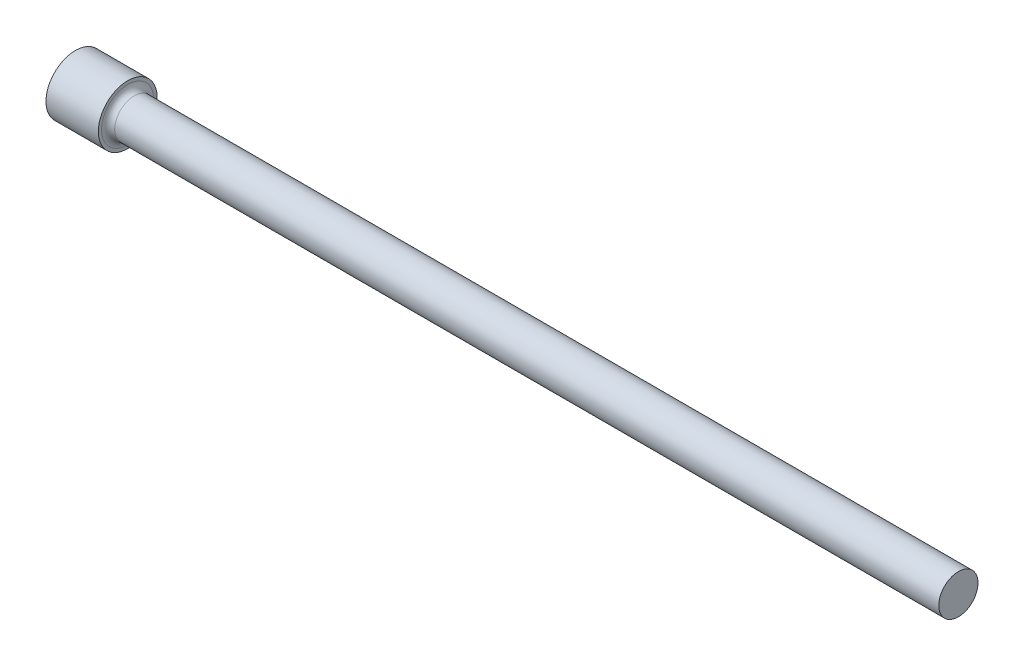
ISO-10303-21;
HEADER;
FILE_DESCRIPTION(('STEP AP214'),'2;1');
FILE_NAME('part.step','',(''),(''),'','','');
FILE_SCHEMA(('AUTOMOTIVE_DESIGN { 1 0 10303 214 1 1 1 1 }'));
ENDSEC;
DATA;
#1=APPLICATION_CONTEXT('core data for automotive mechanical design processes');
#2=APPLICATION_PROTOCOL_DEFINITION('international standard','automotive_design',2000,#1);
#3=PRODUCT_CONTEXT('',#1,'mechanical');
#4=PRODUCT('Part','Part','',(#3));
#5=PRODUCT_RELATED_PRODUCT_CATEGORY('part','',(#4));
#6=PRODUCT_DEFINITION_FORMATION('','',#4);
#7=PRODUCT_DEFINITION_CONTEXT('part definition',#1,'design');
#8=PRODUCT_DEFINITION('design','',#6,#7);
#9=PRODUCT_DEFINITION_SHAPE('','',#8);
#10=(LENGTH_UNIT() NAMED_UNIT(*) SI_UNIT(.MILLI.,.METRE.));
#11=(NAMED_UNIT(*) PLANE_ANGLE_UNIT() SI_UNIT($,.RADIAN.));
#12=(NAMED_UNIT(*) SI_UNIT($,.STERADIAN.) SOLID_ANGLE_UNIT());
#13=UNCERTAINTY_MEASURE_WITH_UNIT(LENGTH_MEASURE(1.E-05),#10,'distance_accuracy_value','');
#14=(GEOMETRIC_REPRESENTATION_CONTEXT(3) GLOBAL_UNCERTAINTY_ASSIGNED_CONTEXT((#13)) GLOBAL_UNIT_ASSIGNED_CONTEXT((#10,
#11,#12)) REPRESENTATION_CONTEXT('',''));
#15=CARTESIAN_POINT('',(0.,0.,0.));
#16=DIRECTION('',(0.,0.,1.));
#17=DIRECTION('',(1.,0.,0.));
#18=AXIS2_PLACEMENT_3D('',#15,#16,#17);
#19=CARTESIAN_POINT('',(0.,2.25,0.));
#20=DIRECTION('',(1.,0.,0.));
#21=DIRECTION('',(0.,0.,-1.));
#22=AXIS2_PLACEMENT_3D('',#19,#20,#21);
#23=PLANE('',#22);
#24=CARTESIAN_POINT('',(0.,0.,0.));
#25=DIRECTION('',(-1.,0.,0.));
#26=DIRECTION('',(0.,0.,1.));
#27=AXIS2_PLACEMENT_3D('',#24,#25,#26);
#28=CIRCLE('',#27,2.25);
#29=CARTESIAN_POINT('',(0.,0.,2.25));
#30=VERTEX_POINT('',#29);
#31=EDGE_CURVE('E54',#30,#30,#28,.T.);
#32=ORIENTED_EDGE('',*,*,#31,.T.);
#33=EDGE_LOOP('',(#32));
#34=FACE_BOUND('',#33,.T.);
#35=ADVANCED_FACE('F32',(#34),#23,.F.);
#36=CARTESIAN_POINT('',(0.,0.,0.));
#37=DIRECTION('',(-1.,0.,0.));
#38=DIRECTION('',(0.,0.,1.));
#39=AXIS2_PLACEMENT_3D('',#36,#37,#38);
#40=CYLINDRICAL_SURFACE('',#39,1.5);
#41=CARTESIAN_POINT('',(67.5,0.,0.));
#42=DIRECTION('',(-1.,0.,0.));
#43=DIRECTION('',(0.,-1.,0.));
#44=AXIS2_PLACEMENT_3D('',#41,#42,#43);
#45=CIRCLE('',#44,1.5);
#46=CARTESIAN_POINT('',(67.5,-1.5,0.));
#47=VERTEX_POINT('',#46);
#48=EDGE_CURVE('E35',#47,#47,#45,.T.);
#49=ORIENTED_EDGE('',*,*,#48,.T.);
#50=EDGE_LOOP('',(#49));
#51=FACE_BOUND('',#50,.T.);
#52=CARTESIAN_POINT('',(4.5,0.,0.));
#53=DIRECTION('',(-1.,0.,0.));
#54=DIRECTION('',(0.,0.,1.));
#55=AXIS2_PLACEMENT_3D('',#52,#53,#54);
#56=CIRCLE('',#55,1.5);
#57=CARTESIAN_POINT('',(4.5,0.,1.5));
#58=VERTEX_POINT('',#57);
#59=EDGE_CURVE('E10',#58,#58,#56,.T.);
#60=ORIENTED_EDGE('',*,*,#59,.F.);
#61=EDGE_LOOP('',(#60));
#62=FACE_BOUND('',#61,.T.);
#63=ADVANCED_FACE('F64',(#51,#62),#40,.T.);
#64=CARTESIAN_POINT('',(4.5,0.,0.));
#65=DIRECTION('',(-1.,0.,0.));
#66=DIRECTION('',(0.,0.,1.));
#67=AXIS2_PLACEMENT_3D('',#64,#65,#66);
#68=TOROIDAL_SURFACE('',#67,2.,0.5);
#69=ORIENTED_EDGE('',*,*,#59,.T.);
#70=EDGE_LOOP('',(#69));
#71=FACE_BOUND('',#70,.T.);
#72=CARTESIAN_POINT('',(4.,0.,0.));
#73=DIRECTION('',(-1.,0.,0.));
#74=DIRECTION('',(0.,0.,1.));
#75=AXIS2_PLACEMENT_3D('',#72,#73,#74);
#76=CIRCLE('',#75,2.);
#77=CARTESIAN_POINT('',(4.,0.,2.));
#78=VERTEX_POINT('',#77);
#79=EDGE_CURVE('E40',#78,#78,#76,.T.);
#80=ORIENTED_EDGE('',*,*,#79,.F.);
#81=EDGE_LOOP('',(#80));
#82=FACE_BOUND('',#81,.T.);
#83=ADVANCED_FACE('F81',(#71,#82),#68,.F.);
#84=CARTESIAN_POINT('',(4.,2.,0.));
#85=DIRECTION('',(-1.,0.,0.));
#86=DIRECTION('',(0.,0.,1.));
#87=AXIS2_PLACEMENT_3D('',#84,#85,#86);
#88=PLANE('',#87);
#89=CARTESIAN_POINT('',(4.,0.,0.));
#90=DIRECTION('',(-1.,0.,0.));
#91=DIRECTION('',(0.,0.,1.));
#92=AXIS2_PLACEMENT_3D('',#89,#90,#91);
#93=CIRCLE('',#92,2.25);
#94=CARTESIAN_POINT('',(4.,0.,2.25));
#95=VERTEX_POINT('',#94);
#96=EDGE_CURVE('E48',#95,#95,#93,.T.);
#97=ORIENTED_EDGE('',*,*,#96,.F.);
#98=EDGE_LOOP('',(#97));
#99=FACE_BOUND('',#98,.T.);
#100=ORIENTED_EDGE('',*,*,#79,.T.);
#101=EDGE_LOOP('',(#100));
#102=FACE_BOUND('',#101,.T.);
#103=ADVANCED_FACE('F74',(#99,#102),#88,.F.);
#104=CARTESIAN_POINT('',(0.,0.,0.));
#105=DIRECTION('',(-1.,0.,0.));
#106=DIRECTION('',(0.,0.,1.));
#107=AXIS2_PLACEMENT_3D('',#104,#105,#106);
#108=CYLINDRICAL_SURFACE('',#107,2.25);
#109=ORIENTED_EDGE('',*,*,#31,.F.);
#110=EDGE_LOOP('',(#109));
#111=FACE_BOUND('',#110,.T.);
#112=ORIENTED_EDGE('',*,*,#96,.T.);
#113=EDGE_LOOP('',(#112));
#114=FACE_BOUND('',#113,.T.);
#115=ADVANCED_FACE('F69',(#111,#114),#108,.T.);
#116=CARTESIAN_POINT('',(67.5,-28.1902662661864,103.128407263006));
#117=DIRECTION('',(-1.,0.,0.));
#118=DIRECTION('',(0.,-1.,0.));
#119=AXIS2_PLACEMENT_3D('',#116,#117,#118);
#120=PLANE('',#119);
#121=ORIENTED_EDGE('',*,*,#48,.F.);
#122=EDGE_LOOP('',(#121));
#123=FACE_BOUND('',#122,.T.);
#124=ADVANCED_FACE('F67',(#123),#120,.F.);
#125=CLOSED_SHELL('',(#35,#63,#83,#103,#115,#124));
#126=MANIFOLD_SOLID_BREP('B2',#125);
#127=ADVANCED_BREP_SHAPE_REPRESENTATION('',(#18,#126),#14);
#128=SHAPE_DEFINITION_REPRESENTATION(#9,#127);
ENDSEC;
END-ISO-10303-21;
